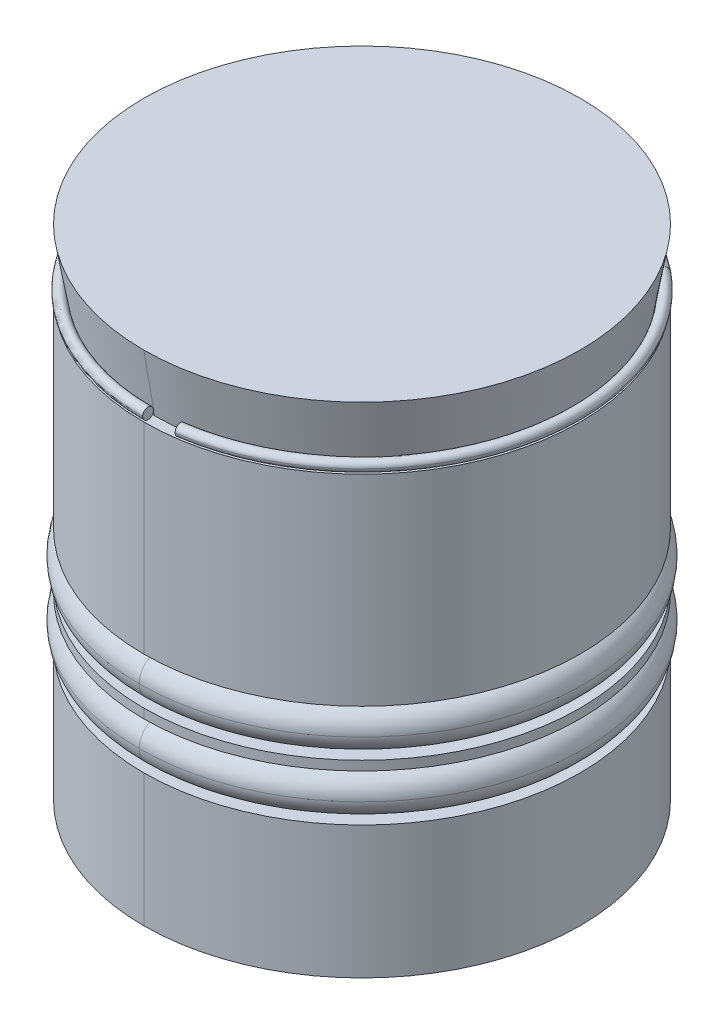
ISO-10303-21;
HEADER;
FILE_DESCRIPTION(('STEP AP214'),'2;1');
FILE_NAME('part.step','',(''),(''),'','','');
FILE_SCHEMA(('AUTOMOTIVE_DESIGN { 1 0 10303 214 1 1 1 1 }'));
ENDSEC;
DATA;
#1=APPLICATION_CONTEXT('core data for automotive mechanical design processes');
#2=APPLICATION_PROTOCOL_DEFINITION('international standard','automotive_design',2000,#1);
#3=PRODUCT_CONTEXT('',#1,'mechanical');
#4=PRODUCT('Part','Part','',(#3));
#5=PRODUCT_RELATED_PRODUCT_CATEGORY('part','',(#4));
#6=PRODUCT_DEFINITION_FORMATION('','',#4);
#7=PRODUCT_DEFINITION_CONTEXT('part definition',#1,'design');
#8=PRODUCT_DEFINITION('design','',#6,#7);
#9=PRODUCT_DEFINITION_SHAPE('','',#8);
#10=(LENGTH_UNIT() NAMED_UNIT(*) SI_UNIT(.MILLI.,.METRE.));
#11=(NAMED_UNIT(*) PLANE_ANGLE_UNIT() SI_UNIT($,.RADIAN.));
#12=(NAMED_UNIT(*) SI_UNIT($,.STERADIAN.) SOLID_ANGLE_UNIT());
#13=UNCERTAINTY_MEASURE_WITH_UNIT(LENGTH_MEASURE(1.E-05),#10,'distance_accuracy_value','');
#14=(GEOMETRIC_REPRESENTATION_CONTEXT(3) GLOBAL_UNCERTAINTY_ASSIGNED_CONTEXT((#13)) GLOBAL_UNIT_ASSIGNED_CONTEXT((#10,
#11,#12)) REPRESENTATION_CONTEXT('',''));
#15=CARTESIAN_POINT('',(0.,0.,0.));
#16=DIRECTION('',(0.,0.,1.));
#17=DIRECTION('',(1.,0.,0.));
#18=AXIS2_PLACEMENT_3D('',#15,#16,#17);
#19=CARTESIAN_POINT('',(0.,6.8,0.));
#20=DIRECTION('',(0.,1.,0.));
#21=DIRECTION('',(0.,0.,1.));
#22=AXIS2_PLACEMENT_3D('',#19,#20,#21);
#23=TOROIDAL_SURFACE('',#22,6.5,0.65);
#24=CARTESIAN_POINT('',(0.,6.8,0.));
#25=DIRECTION('',(0.,1.,0.));
#26=DIRECTION('',(0.,0.,1.));
#27=AXIS2_PLACEMENT_3D('',#24,#25,#26);
#28=CIRCLE('',#27,7.15);
#29=CARTESIAN_POINT('',(0.,6.8,-7.15));
#30=VERTEX_POINT('',#29);
#31=CARTESIAN_POINT('',(0.,6.8,7.15));
#32=VERTEX_POINT('',#31);
#33=EDGE_CURVE('P0_E57',#30,#32,#28,.T.);
#34=ORIENTED_EDGE('',*,*,#33,.F.);
#35=CARTESIAN_POINT('',(0.,6.8,-6.5));
#36=DIRECTION('',(1.,0.,0.));
#37=DIRECTION('',(0.,0.,-1.));
#38=AXIS2_PLACEMENT_3D('',#35,#36,#37);
#39=CIRCLE('',#38,0.65);
#40=CARTESIAN_POINT('',(0.,6.8,-5.85));
#41=VERTEX_POINT('',#40);
#42=EDGE_CURVE('P0_E11',#41,#30,#39,.T.);
#43=ORIENTED_EDGE('',*,*,#42,.F.);
#44=CARTESIAN_POINT('',(0.,6.8,0.));
#45=DIRECTION('',(0.,1.,0.));
#46=DIRECTION('',(0.,0.,1.));
#47=AXIS2_PLACEMENT_3D('',#44,#45,#46);
#48=CIRCLE('',#47,5.85);
#49=CARTESIAN_POINT('',(0.,6.8,5.85));
#50=VERTEX_POINT('',#49);
#51=EDGE_CURVE('P0_E54',#41,#50,#48,.T.);
#52=ORIENTED_EDGE('',*,*,#51,.T.);
#53=CARTESIAN_POINT('',(0.,6.8,6.5));
#54=DIRECTION('',(-1.,0.,0.));
#55=DIRECTION('',(0.,0.,1.));
#56=AXIS2_PLACEMENT_3D('',#53,#54,#55);
#57=CIRCLE('',#56,0.65);
#58=EDGE_CURVE('P0_E27',#50,#32,#57,.T.);
#59=ORIENTED_EDGE('',*,*,#58,.T.);
#60=EDGE_LOOP('',(#34,#43,#52,#59));
#61=FACE_BOUND('',#60,.T.);
#62=ADVANCED_FACE('P0_F16',(#61),#23,.T.);
#63=CARTESIAN_POINT('',(0.,6.8,0.));
#64=DIRECTION('',(0.,1.,0.));
#65=DIRECTION('',(0.,0.,1.));
#66=AXIS2_PLACEMENT_3D('',#63,#64,#65);
#67=TOROIDAL_SURFACE('',#66,6.5,0.65);
#68=CARTESIAN_POINT('',(0.,6.8,0.));
#69=DIRECTION('',(0.,1.,0.));
#70=DIRECTION('',(0.,0.,1.));
#71=AXIS2_PLACEMENT_3D('',#68,#69,#70);
#72=CIRCLE('',#71,7.15);
#73=EDGE_CURVE('P0_E65',#32,#30,#72,.T.);
#74=ORIENTED_EDGE('',*,*,#73,.F.);
#75=ORIENTED_EDGE('',*,*,#58,.F.);
#76=CARTESIAN_POINT('',(0.,6.8,0.));
#77=DIRECTION('',(0.,1.,0.));
#78=DIRECTION('',(0.,0.,1.));
#79=AXIS2_PLACEMENT_3D('',#76,#77,#78);
#80=CIRCLE('',#79,5.85);
#81=EDGE_CURVE('P0_E20',#50,#41,#80,.T.);
#82=ORIENTED_EDGE('',*,*,#81,.T.);
#83=ORIENTED_EDGE('',*,*,#42,.T.);
#84=EDGE_LOOP('',(#74,#75,#82,#83));
#85=FACE_BOUND('',#84,.T.);
#86=ADVANCED_FACE('P0_F60',(#85),#67,.T.);
#87=CARTESIAN_POINT('',(0.,6.8,0.));
#88=DIRECTION('',(0.,1.,0.));
#89=DIRECTION('',(0.,0.,1.));
#90=AXIS2_PLACEMENT_3D('',#87,#88,#89);
#91=TOROIDAL_SURFACE('',#90,6.5,0.65);
#92=CARTESIAN_POINT('',(0.,6.8,6.5));
#93=DIRECTION('',(-1.,0.,0.));
#94=DIRECTION('',(0.,0.,1.));
#95=AXIS2_PLACEMENT_3D('',#92,#93,#94);
#96=CIRCLE('',#95,0.65);
#97=EDGE_CURVE('P0_E69',#32,#50,#96,.T.);
#98=ORIENTED_EDGE('',*,*,#97,.F.);
#99=ORIENTED_EDGE('',*,*,#73,.T.);
#100=CARTESIAN_POINT('',(0.,6.8,-6.5));
#101=DIRECTION('',(1.,0.,0.));
#102=DIRECTION('',(0.,0.,-1.));
#103=AXIS2_PLACEMENT_3D('',#100,#101,#102);
#104=CIRCLE('',#103,0.65);
#105=EDGE_CURVE('P0_E68',#30,#41,#104,.T.);
#106=ORIENTED_EDGE('',*,*,#105,.T.);
#107=ORIENTED_EDGE('',*,*,#81,.F.);
#108=EDGE_LOOP('',(#98,#99,#106,#107));
#109=FACE_BOUND('',#108,.T.);
#110=ADVANCED_FACE('P0_F18',(#109),#91,.T.);
#111=CARTESIAN_POINT('',(0.,6.8,0.));
#112=DIRECTION('',(0.,1.,0.));
#113=DIRECTION('',(0.,0.,1.));
#114=AXIS2_PLACEMENT_3D('',#111,#112,#113);
#115=TOROIDAL_SURFACE('',#114,6.5,0.65);
#116=ORIENTED_EDGE('',*,*,#105,.F.);
#117=ORIENTED_EDGE('',*,*,#33,.T.);
#118=ORIENTED_EDGE('',*,*,#97,.T.);
#119=ORIENTED_EDGE('',*,*,#51,.F.);
#120=EDGE_LOOP('',(#116,#117,#118,#119));
#121=FACE_BOUND('',#120,.T.);
#122=ADVANCED_FACE('P0_F67',(#121),#115,.T.);
#123=CLOSED_SHELL('',(#62,#86,#110,#122));
#124=MANIFOLD_SOLID_BREP('P0_B1',#123);
#125=CARTESIAN_POINT('',(0.,5.,0.));
#126=DIRECTION('',(0.,1.,0.));
#127=DIRECTION('',(0.,0.,1.));
#128=AXIS2_PLACEMENT_3D('',#125,#126,#127);
#129=TOROIDAL_SURFACE('',#128,6.5,0.65);
#130=CARTESIAN_POINT('',(0.,5.,0.));
#131=DIRECTION('',(0.,1.,0.));
#132=DIRECTION('',(0.,0.,1.));
#133=AXIS2_PLACEMENT_3D('',#130,#131,#132);
#134=CIRCLE('',#133,7.15);
#135=CARTESIAN_POINT('',(0.,5.,-7.15));
#136=VERTEX_POINT('',#135);
#137=CARTESIAN_POINT('',(0.,5.,7.15));
#138=VERTEX_POINT('',#137);
#139=EDGE_CURVE('P1_E71',#136,#138,#134,.T.);
#140=ORIENTED_EDGE('',*,*,#139,.F.);
#141=CARTESIAN_POINT('',(0.,5.,-6.5));
#142=DIRECTION('',(1.,0.,0.));
#143=DIRECTION('',(0.,0.,-1.));
#144=AXIS2_PLACEMENT_3D('',#141,#142,#143);
#145=CIRCLE('',#144,0.65);
#146=CARTESIAN_POINT('',(0.,5.,-5.85));
#147=VERTEX_POINT('',#146);
#148=EDGE_CURVE('P1_E11',#147,#136,#145,.T.);
#149=ORIENTED_EDGE('',*,*,#148,.F.);
#150=CARTESIAN_POINT('',(0.,5.,0.));
#151=DIRECTION('',(0.,1.,0.));
#152=DIRECTION('',(0.,0.,1.));
#153=AXIS2_PLACEMENT_3D('',#150,#151,#152);
#154=CIRCLE('',#153,5.85);
#155=CARTESIAN_POINT('',(0.,5.,5.85));
#156=VERTEX_POINT('',#155);
#157=EDGE_CURVE('P1_E69',#147,#156,#154,.T.);
#158=ORIENTED_EDGE('',*,*,#157,.T.);
#159=CARTESIAN_POINT('',(0.,5.,6.5));
#160=DIRECTION('',(-1.,0.,0.));
#161=DIRECTION('',(0.,0.,1.));
#162=AXIS2_PLACEMENT_3D('',#159,#160,#161);
#163=CIRCLE('',#162,0.65);
#164=EDGE_CURVE('P1_E20',#156,#138,#163,.T.);
#165=ORIENTED_EDGE('',*,*,#164,.T.);
#166=EDGE_LOOP('',(#140,#149,#158,#165));
#167=FACE_BOUND('',#166,.T.);
#168=ADVANCED_FACE('P1_F16',(#167),#129,.T.);
#169=CARTESIAN_POINT('',(0.,5.,0.));
#170=DIRECTION('',(0.,1.,0.));
#171=DIRECTION('',(0.,0.,1.));
#172=AXIS2_PLACEMENT_3D('',#169,#170,#171);
#173=TOROIDAL_SURFACE('',#172,6.5,0.65);
#174=CARTESIAN_POINT('',(0.,5.,0.));
#175=DIRECTION('',(0.,1.,0.));
#176=DIRECTION('',(0.,0.,1.));
#177=AXIS2_PLACEMENT_3D('',#174,#175,#176);
#178=CIRCLE('',#177,7.15);
#179=EDGE_CURVE('P1_E56',#138,#136,#178,.T.);
#180=ORIENTED_EDGE('',*,*,#179,.F.);
#181=ORIENTED_EDGE('',*,*,#164,.F.);
#182=CARTESIAN_POINT('',(0.,5.,0.));
#183=DIRECTION('',(0.,1.,0.));
#184=DIRECTION('',(0.,0.,1.));
#185=AXIS2_PLACEMENT_3D('',#182,#183,#184);
#186=CIRCLE('',#185,5.85);
#187=EDGE_CURVE('P1_E58',#156,#147,#186,.T.);
#188=ORIENTED_EDGE('',*,*,#187,.T.);
#189=ORIENTED_EDGE('',*,*,#148,.T.);
#190=EDGE_LOOP('',(#180,#181,#188,#189));
#191=FACE_BOUND('',#190,.T.);
#192=ADVANCED_FACE('P1_F18',(#191),#173,.T.);
#193=CARTESIAN_POINT('',(0.,5.,0.));
#194=DIRECTION('',(0.,1.,0.));
#195=DIRECTION('',(0.,0.,1.));
#196=AXIS2_PLACEMENT_3D('',#193,#194,#195);
#197=TOROIDAL_SURFACE('',#196,6.5,0.65);
#198=CARTESIAN_POINT('',(0.,5.,6.5));
#199=DIRECTION('',(-1.,0.,0.));
#200=DIRECTION('',(0.,0.,1.));
#201=AXIS2_PLACEMENT_3D('',#198,#199,#200);
#202=CIRCLE('',#201,0.65);
#203=EDGE_CURVE('P1_E66',#138,#156,#202,.T.);
#204=ORIENTED_EDGE('',*,*,#203,.F.);
#205=ORIENTED_EDGE('',*,*,#179,.T.);
#206=CARTESIAN_POINT('',(0.,5.,-6.5));
#207=DIRECTION('',(1.,0.,0.));
#208=DIRECTION('',(0.,0.,-1.));
#209=AXIS2_PLACEMENT_3D('',#206,#207,#208);
#210=CIRCLE('',#209,0.65);
#211=EDGE_CURVE('P1_E64',#136,#147,#210,.T.);
#212=ORIENTED_EDGE('',*,*,#211,.T.);
#213=ORIENTED_EDGE('',*,*,#187,.F.);
#214=EDGE_LOOP('',(#204,#205,#212,#213));
#215=FACE_BOUND('',#214,.T.);
#216=ADVANCED_FACE('P1_F62',(#215),#197,.T.);
#217=CARTESIAN_POINT('',(0.,5.,0.));
#218=DIRECTION('',(0.,1.,0.));
#219=DIRECTION('',(0.,0.,1.));
#220=AXIS2_PLACEMENT_3D('',#217,#218,#219);
#221=TOROIDAL_SURFACE('',#220,6.5,0.65);
#222=ORIENTED_EDGE('',*,*,#211,.F.);
#223=ORIENTED_EDGE('',*,*,#139,.T.);
#224=ORIENTED_EDGE('',*,*,#203,.T.);
#225=ORIENTED_EDGE('',*,*,#157,.F.);
#226=EDGE_LOOP('',(#222,#223,#224,#225));
#227=FACE_BOUND('',#226,.T.);
#228=ADVANCED_FACE('P1_F74',(#227),#221,.T.);
#229=CLOSED_SHELL('',(#168,#192,#216,#228));
#230=MANIFOLD_SOLID_BREP('P1_B1',#229);
#231=CARTESIAN_POINT('',(0.,16.,0.));
#232=DIRECTION('',(0.,-1.,0.));
#233=DIRECTION('',(0.,0.,-1.));
#234=AXIS2_PLACEMENT_3D('',#231,#232,#233);
#235=PLANE('',#234);
#236=CARTESIAN_POINT('',(0.,16.,0.));
#237=DIRECTION('',(0.,1.,0.));
#238=DIRECTION('',(0.,0.,1.));
#239=AXIS2_PLACEMENT_3D('',#236,#237,#238);
#240=CIRCLE('',#239,7.);
#241=CARTESIAN_POINT('',(0.,16.,7.));
#242=VERTEX_POINT('',#241);
#243=CARTESIAN_POINT('',(0.,16.,-7.));
#244=VERTEX_POINT('',#243);
#245=EDGE_CURVE('P2_E204',#242,#244,#240,.T.);
#246=ORIENTED_EDGE('',*,*,#245,.T.);
#247=CARTESIAN_POINT('',(0.,16.,0.));
#248=DIRECTION('',(0.,1.,0.));
#249=DIRECTION('',(0.,0.,1.));
#250=AXIS2_PLACEMENT_3D('',#247,#248,#249);
#251=CIRCLE('',#250,7.);
#252=EDGE_CURVE('P2_E11',#244,#242,#251,.T.);
#253=ORIENTED_EDGE('',*,*,#252,.T.);
#254=EDGE_LOOP('',(#246,#253));
#255=FACE_BOUND('',#254,.T.);
#256=ADVANCED_FACE('P2_F16',(#255),#235,.F.);
#257=CARTESIAN_POINT('',(0.,14.,0.));
#258=DIRECTION('',(0.,1.,0.));
#259=DIRECTION('',(0.,0.,1.));
#260=AXIS2_PLACEMENT_3D('',#257,#258,#259);
#261=CONICAL_SURFACE('',#260,6.65371595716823,0.171442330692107);
#262=DIRECTION('',(0.,0.985339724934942,-0.17060371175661));
#263=VECTOR('',#262,1.);
#264=CARTESIAN_POINT('',(0.,14.,-6.65371595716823));
#265=LINE('',#264,#263);
#266=CARTESIAN_POINT('',(0.,14.,-6.65371595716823));
#267=VERTEX_POINT('',#266);
#268=EDGE_CURVE('P2_E217',#267,#244,#265,.T.);
#269=ORIENTED_EDGE('',*,*,#268,.F.);
#270=CARTESIAN_POINT('',(0.,14.,0.));
#271=DIRECTION('',(0.,1.,0.));
#272=DIRECTION('',(0.,0.,1.));
#273=AXIS2_PLACEMENT_3D('',#270,#271,#272);
#274=CIRCLE('',#273,6.65371595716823);
#275=CARTESIAN_POINT('',(0.,14.,6.65371595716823));
#276=VERTEX_POINT('',#275);
#277=EDGE_CURVE('P2_E27',#267,#276,#274,.T.);
#278=ORIENTED_EDGE('',*,*,#277,.T.);
#279=DIRECTION('',(0.,0.985339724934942,0.17060371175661));
#280=VECTOR('',#279,1.);
#281=CARTESIAN_POINT('',(0.,14.,6.65371595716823));
#282=LINE('',#281,#280);
#283=EDGE_CURVE('P2_E197',#276,#242,#282,.T.);
#284=ORIENTED_EDGE('',*,*,#283,.T.);
#285=ORIENTED_EDGE('',*,*,#252,.F.);
#286=EDGE_LOOP('',(#269,#278,#284,#285));
#287=FACE_BOUND('',#286,.T.);
#288=ADVANCED_FACE('P2_F400',(#287),#261,.T.);
#289=CARTESIAN_POINT('',(0.,14.,-7.));
#290=DIRECTION('',(0.,-1.,0.));
#291=DIRECTION('',(0.,0.,-1.));
#292=AXIS2_PLACEMENT_3D('',#289,#290,#291);
#293=PLANE('',#292);
#294=CARTESIAN_POINT('',(0.,14.,0.));
#295=DIRECTION('',(0.,1.,0.));
#296=DIRECTION('',(0.,0.,1.));
#297=AXIS2_PLACEMENT_3D('',#294,#295,#296);
#298=CIRCLE('',#297,6.65371595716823);
#299=EDGE_CURVE('P2_E221',#276,#267,#298,.T.);
#300=ORIENTED_EDGE('',*,*,#299,.F.);
#301=ORIENTED_EDGE('',*,*,#277,.F.);
#302=EDGE_LOOP('',(#300,#301));
#303=FACE_BOUND('',#302,.T.);
#304=CARTESIAN_POINT('',(0.,14.,0.));
#305=DIRECTION('',(0.,1.,0.));
#306=DIRECTION('',(0.,0.,1.));
#307=AXIS2_PLACEMENT_3D('',#304,#305,#306);
#308=CIRCLE('',#307,7.);
#309=CARTESIAN_POINT('',(0.,14.,7.));
#310=VERTEX_POINT('',#309);
#311=CARTESIAN_POINT('',(0.,14.,-7.));
#312=VERTEX_POINT('',#311);
#313=EDGE_CURVE('P2_E192',#310,#312,#308,.T.);
#314=ORIENTED_EDGE('',*,*,#313,.T.);
#315=CARTESIAN_POINT('',(0.,14.,0.));
#316=DIRECTION('',(0.,1.,0.));
#317=DIRECTION('',(0.,0.,1.));
#318=AXIS2_PLACEMENT_3D('',#315,#316,#317);
#319=CIRCLE('',#318,7.);
#320=EDGE_CURVE('P2_E140',#312,#310,#319,.T.);
#321=ORIENTED_EDGE('',*,*,#320,.T.);
#322=EDGE_LOOP('',(#314,#321));
#323=FACE_BOUND('',#322,.T.);
#324=ADVANCED_FACE('P2_F406',(#303,#323),#293,.F.);
#325=CARTESIAN_POINT('',(0.,16.,0.));
#326=DIRECTION('',(0.,1.,0.));
#327=DIRECTION('',(0.,0.,1.));
#328=AXIS2_PLACEMENT_3D('',#325,#326,#327);
#329=CYLINDRICAL_SURFACE('',#328,7.);
#330=DIRECTION('',(0.,1.,0.));
#331=VECTOR('',#330,1.);
#332=CARTESIAN_POINT('',(0.,16.,-7.));
#333=LINE('',#332,#331);
#334=CARTESIAN_POINT('',(0.,7.55,-7.));
#335=VERTEX_POINT('',#334);
#336=EDGE_CURVE('P2_E187',#335,#312,#333,.T.);
#337=ORIENTED_EDGE('',*,*,#336,.F.);
#338=CARTESIAN_POINT('',(0.,7.55,0.));
#339=DIRECTION('',(0.,1.,0.));
#340=DIRECTION('',(0.,0.,1.));
#341=AXIS2_PLACEMENT_3D('',#338,#339,#340);
#342=CIRCLE('',#341,7.);
#343=CARTESIAN_POINT('',(0.,7.55,7.));
#344=VERTEX_POINT('',#343);
#345=EDGE_CURVE('P2_E20',#335,#344,#342,.T.);
#346=ORIENTED_EDGE('',*,*,#345,.T.);
#347=DIRECTION('',(0.,1.,0.));
#348=VECTOR('',#347,1.);
#349=CARTESIAN_POINT('',(0.,16.,7.));
#350=LINE('',#349,#348);
#351=EDGE_CURVE('P2_E195',#344,#310,#350,.T.);
#352=ORIENTED_EDGE('',*,*,#351,.T.);
#353=ORIENTED_EDGE('',*,*,#320,.F.);
#354=EDGE_LOOP('',(#337,#346,#352,#353));
#355=FACE_BOUND('',#354,.T.);
#356=ADVANCED_FACE('P2_F188',(#355),#329,.T.);
#357=CARTESIAN_POINT('',(0.,7.55,-6.5));
#358=DIRECTION('',(0.,1.,0.));
#359=DIRECTION('',(0.,0.,-1.));
#360=AXIS2_PLACEMENT_3D('',#357,#358,#359);
#361=PLANE('',#360);
#362=CARTESIAN_POINT('',(0.,7.55,0.));
#363=DIRECTION('',(0.,1.,0.));
#364=DIRECTION('',(0.,0.,1.));
#365=AXIS2_PLACEMENT_3D('',#362,#363,#364);
#366=CIRCLE('',#365,6.5);
#367=CARTESIAN_POINT('',(0.,7.55,6.5));
#368=VERTEX_POINT('',#367);
#369=CARTESIAN_POINT('',(0.,7.55,-6.5));
#370=VERTEX_POINT('',#369);
#371=EDGE_CURVE('P2_E215',#368,#370,#366,.T.);
#372=ORIENTED_EDGE('',*,*,#371,.T.);
#373=CARTESIAN_POINT('',(0.,7.55,0.));
#374=DIRECTION('',(0.,1.,0.));
#375=DIRECTION('',(0.,0.,1.));
#376=AXIS2_PLACEMENT_3D('',#373,#374,#375);
#377=CIRCLE('',#376,6.5);
#378=EDGE_CURVE('P2_E77',#370,#368,#377,.T.);
#379=ORIENTED_EDGE('',*,*,#378,.T.);
#380=EDGE_LOOP('',(#372,#379));
#381=FACE_BOUND('',#380,.T.);
#382=CARTESIAN_POINT('',(0.,7.55,0.));
#383=DIRECTION('',(0.,1.,0.));
#384=DIRECTION('',(0.,0.,1.));
#385=AXIS2_PLACEMENT_3D('',#382,#383,#384);
#386=CIRCLE('',#385,7.);
#387=EDGE_CURVE('P2_E182',#344,#335,#386,.T.);
#388=ORIENTED_EDGE('',*,*,#387,.F.);
#389=ORIENTED_EDGE('',*,*,#345,.F.);
#390=EDGE_LOOP('',(#388,#389));
#391=FACE_BOUND('',#390,.T.);
#392=ADVANCED_FACE('P2_F180',(#381,#391),#361,.F.);
#393=CARTESIAN_POINT('',(0.,6.8,0.));
#394=DIRECTION('',(0.,1.,0.));
#395=DIRECTION('',(0.,0.,1.));
#396=AXIS2_PLACEMENT_3D('',#393,#394,#395);
#397=TOROIDAL_SURFACE('',#396,6.5,0.75);
#398=CARTESIAN_POINT('',(0.,6.8,0.));
#399=DIRECTION('',(0.,1.,0.));
#400=DIRECTION('',(0.,0.,1.));
#401=AXIS2_PLACEMENT_3D('',#398,#399,#400);
#402=CIRCLE('',#401,5.75);
#403=CARTESIAN_POINT('',(0.,6.8,5.75));
#404=VERTEX_POINT('',#403);
#405=CARTESIAN_POINT('',(0.,6.8,-5.75));
#406=VERTEX_POINT('',#405);
#407=EDGE_CURVE('P2_E216',#404,#406,#402,.T.);
#408=ORIENTED_EDGE('',*,*,#407,.F.);
#409=CARTESIAN_POINT('',(0.,6.8,6.5));
#410=DIRECTION('',(-1.,0.,0.));
#411=DIRECTION('',(0.,0.,1.));
#412=AXIS2_PLACEMENT_3D('',#409,#410,#411);
#413=CIRCLE('',#412,0.75);
#414=CARTESIAN_POINT('',(0.,6.05,6.5));
#415=VERTEX_POINT('',#414);
#416=EDGE_CURVE('P2_E94',#404,#415,#413,.T.);
#417=ORIENTED_EDGE('',*,*,#416,.T.);
#418=CARTESIAN_POINT('',(0.,6.05,0.));
#419=DIRECTION('',(0.,1.,0.));
#420=DIRECTION('',(0.,0.,1.));
#421=AXIS2_PLACEMENT_3D('',#418,#419,#420);
#422=CIRCLE('',#421,6.5);
#423=CARTESIAN_POINT('',(0.,6.05,-6.5));
#424=VERTEX_POINT('',#423);
#425=EDGE_CURVE('P2_E127',#415,#424,#422,.T.);
#426=ORIENTED_EDGE('',*,*,#425,.T.);
#427=CARTESIAN_POINT('',(0.,6.8,-6.5));
#428=DIRECTION('',(1.,0.,0.));
#429=DIRECTION('',(0.,0.,-1.));
#430=AXIS2_PLACEMENT_3D('',#427,#428,#429);
#431=CIRCLE('',#430,0.75);
#432=EDGE_CURVE('P2_E231',#406,#424,#431,.T.);
#433=ORIENTED_EDGE('',*,*,#432,.F.);
#434=EDGE_LOOP('',(#408,#417,#426,#433));
#435=FACE_BOUND('',#434,.T.);
#436=ADVANCED_FACE('P2_F348',(#435),#397,.F.);
#437=CARTESIAN_POINT('',(0.,6.05,-6.5));
#438=DIRECTION('',(0.,-1.,0.));
#439=DIRECTION('',(0.,0.,-1.));
#440=AXIS2_PLACEMENT_3D('',#437,#438,#439);
#441=PLANE('',#440);
#442=ORIENTED_EDGE('',*,*,#425,.F.);
#443=CARTESIAN_POINT('',(0.,6.05,0.));
#444=DIRECTION('',(0.,1.,0.));
#445=DIRECTION('',(0.,0.,1.));
#446=AXIS2_PLACEMENT_3D('',#443,#444,#445);
#447=CIRCLE('',#446,6.5);
#448=EDGE_CURVE('P2_E235',#424,#415,#447,.T.);
#449=ORIENTED_EDGE('',*,*,#448,.F.);
#450=EDGE_LOOP('',(#442,#449));
#451=FACE_BOUND('',#450,.T.);
#452=CARTESIAN_POINT('',(0.,6.05,0.));
#453=DIRECTION('',(0.,1.,0.));
#454=DIRECTION('',(0.,0.,1.));
#455=AXIS2_PLACEMENT_3D('',#452,#453,#454);
#456=CIRCLE('',#455,7.);
#457=CARTESIAN_POINT('',(0.,6.05,7.));
#458=VERTEX_POINT('',#457);
#459=CARTESIAN_POINT('',(0.,6.05,-7.));
#460=VERTEX_POINT('',#459);
#461=EDGE_CURVE('P2_E251',#458,#460,#456,.T.);
#462=ORIENTED_EDGE('',*,*,#461,.T.);
#463=CARTESIAN_POINT('',(0.,6.05,0.));
#464=DIRECTION('',(0.,1.,0.));
#465=DIRECTION('',(0.,0.,1.));
#466=AXIS2_PLACEMENT_3D('',#463,#464,#465);
#467=CIRCLE('',#466,7.);
#468=EDGE_CURVE('P2_E240',#460,#458,#467,.T.);
#469=ORIENTED_EDGE('',*,*,#468,.T.);
#470=EDGE_LOOP('',(#462,#469));
#471=FACE_BOUND('',#470,.T.);
#472=ADVANCED_FACE('P2_F351',(#451,#471),#441,.F.);
#473=CARTESIAN_POINT('',(0.,16.,0.));
#474=DIRECTION('',(0.,1.,0.));
#475=DIRECTION('',(0.,0.,1.));
#476=AXIS2_PLACEMENT_3D('',#473,#474,#475);
#477=CYLINDRICAL_SURFACE('',#476,7.);
#478=DIRECTION('',(0.,1.,0.));
#479=VECTOR('',#478,1.);
#480=CARTESIAN_POINT('',(0.,16.,-7.));
#481=LINE('',#480,#479);
#482=CARTESIAN_POINT('',(0.,5.75,-7.));
#483=VERTEX_POINT('',#482);
#484=EDGE_CURVE('P2_E256',#483,#460,#481,.T.);
#485=ORIENTED_EDGE('',*,*,#484,.F.);
#486=CARTESIAN_POINT('',(0.,5.75,0.));
#487=DIRECTION('',(0.,1.,0.));
#488=DIRECTION('',(0.,0.,1.));
#489=AXIS2_PLACEMENT_3D('',#486,#487,#488);
#490=CIRCLE('',#489,7.);
#491=CARTESIAN_POINT('',(0.,5.75,7.));
#492=VERTEX_POINT('',#491);
#493=EDGE_CURVE('P2_E239',#483,#492,#490,.T.);
#494=ORIENTED_EDGE('',*,*,#493,.T.);
#495=DIRECTION('',(0.,1.,0.));
#496=VECTOR('',#495,1.);
#497=CARTESIAN_POINT('',(0.,16.,7.));
#498=LINE('',#497,#496);
#499=EDGE_CURVE('P2_E255',#492,#458,#498,.T.);
#500=ORIENTED_EDGE('',*,*,#499,.T.);
#501=ORIENTED_EDGE('',*,*,#468,.F.);
#502=EDGE_LOOP('',(#485,#494,#500,#501));
#503=FACE_BOUND('',#502,.T.);
#504=ADVANCED_FACE('P2_F354',(#503),#477,.T.);
#505=CARTESIAN_POINT('',(0.,5.75,-6.5));
#506=DIRECTION('',(0.,1.,0.));
#507=DIRECTION('',(0.,0.,-1.));
#508=AXIS2_PLACEMENT_3D('',#505,#506,#507);
#509=PLANE('',#508);
#510=CARTESIAN_POINT('',(0.,5.75,0.));
#511=DIRECTION('',(0.,1.,0.));
#512=DIRECTION('',(0.,0.,1.));
#513=AXIS2_PLACEMENT_3D('',#510,#511,#512);
#514=CIRCLE('',#513,6.5);
#515=CARTESIAN_POINT('',(0.,5.75,6.5));
#516=VERTEX_POINT('',#515);
#517=CARTESIAN_POINT('',(0.,5.75,-6.5));
#518=VERTEX_POINT('',#517);
#519=EDGE_CURVE('P2_E314',#516,#518,#514,.T.);
#520=ORIENTED_EDGE('',*,*,#519,.T.);
#521=CARTESIAN_POINT('',(0.,5.75,0.));
#522=DIRECTION('',(0.,1.,0.));
#523=DIRECTION('',(0.,0.,1.));
#524=AXIS2_PLACEMENT_3D('',#521,#522,#523);
#525=CIRCLE('',#524,6.5);
#526=EDGE_CURVE('P2_E59',#518,#516,#525,.T.);
#527=ORIENTED_EDGE('',*,*,#526,.T.);
#528=EDGE_LOOP('',(#520,#527));
#529=FACE_BOUND('',#528,.T.);
#530=CARTESIAN_POINT('',(0.,5.75,0.));
#531=DIRECTION('',(0.,1.,0.));
#532=DIRECTION('',(0.,0.,1.));
#533=AXIS2_PLACEMENT_3D('',#530,#531,#532);
#534=CIRCLE('',#533,7.);
#535=EDGE_CURVE('P2_E303',#492,#483,#534,.T.);
#536=ORIENTED_EDGE('',*,*,#535,.F.);
#537=ORIENTED_EDGE('',*,*,#493,.F.);
#538=EDGE_LOOP('',(#536,#537));
#539=FACE_BOUND('',#538,.T.);
#540=ADVANCED_FACE('P2_F412',(#529,#539),#509,.F.);
#541=CARTESIAN_POINT('',(0.,5.,0.));
#542=DIRECTION('',(0.,1.,0.));
#543=DIRECTION('',(0.,0.,1.));
#544=AXIS2_PLACEMENT_3D('',#541,#542,#543);
#545=TOROIDAL_SURFACE('',#544,6.5,0.75);
#546=CARTESIAN_POINT('',(0.,5.,0.));
#547=DIRECTION('',(0.,1.,0.));
#548=DIRECTION('',(0.,0.,1.));
#549=AXIS2_PLACEMENT_3D('',#546,#547,#548);
#550=CIRCLE('',#549,5.75);
#551=CARTESIAN_POINT('',(0.,5.,5.75));
#552=VERTEX_POINT('',#551);
#553=CARTESIAN_POINT('',(0.,5.,-5.75));
#554=VERTEX_POINT('',#553);
#555=EDGE_CURVE('P2_E294',#552,#554,#550,.T.);
#556=ORIENTED_EDGE('',*,*,#555,.F.);
#557=CARTESIAN_POINT('',(0.,5.,6.5));
#558=DIRECTION('',(-1.,0.,0.));
#559=DIRECTION('',(0.,0.,1.));
#560=AXIS2_PLACEMENT_3D('',#557,#558,#559);
#561=CIRCLE('',#560,0.75);
#562=CARTESIAN_POINT('',(0.,4.25,6.5));
#563=VERTEX_POINT('',#562);
#564=EDGE_CURVE('P2_E229',#552,#563,#561,.T.);
#565=ORIENTED_EDGE('',*,*,#564,.T.);
#566=CARTESIAN_POINT('',(0.,4.25,0.));
#567=DIRECTION('',(0.,1.,0.));
#568=DIRECTION('',(0.,0.,1.));
#569=AXIS2_PLACEMENT_3D('',#566,#567,#568);
#570=CIRCLE('',#569,6.5);
#571=CARTESIAN_POINT('',(0.,4.25,-6.5));
#572=VERTEX_POINT('',#571);
#573=EDGE_CURVE('P2_E236',#563,#572,#570,.T.);
#574=ORIENTED_EDGE('',*,*,#573,.T.);
#575=CARTESIAN_POINT('',(0.,5.,-6.5));
#576=DIRECTION('',(1.,0.,0.));
#577=DIRECTION('',(0.,0.,-1.));
#578=AXIS2_PLACEMENT_3D('',#575,#576,#577);
#579=CIRCLE('',#578,0.75);
#580=EDGE_CURVE('P2_E230',#554,#572,#579,.T.);
#581=ORIENTED_EDGE('',*,*,#580,.F.);
#582=EDGE_LOOP('',(#556,#565,#574,#581));
#583=FACE_BOUND('',#582,.T.);
#584=ADVANCED_FACE('P2_F374',(#583),#545,.F.);
#585=CARTESIAN_POINT('',(0.,4.25,-6.5));
#586=DIRECTION('',(0.,-1.,0.));
#587=DIRECTION('',(0.,0.,-1.));
#588=AXIS2_PLACEMENT_3D('',#585,#586,#587);
#589=PLANE('',#588);
#590=ORIENTED_EDGE('',*,*,#573,.F.);
#591=CARTESIAN_POINT('',(0.,4.25,0.));
#592=DIRECTION('',(0.,1.,0.));
#593=DIRECTION('',(0.,0.,1.));
#594=AXIS2_PLACEMENT_3D('',#591,#592,#593);
#595=CIRCLE('',#594,6.5);
#596=EDGE_CURVE('P2_E225',#572,#563,#595,.T.);
#597=ORIENTED_EDGE('',*,*,#596,.F.);
#598=EDGE_LOOP('',(#590,#597));
#599=FACE_BOUND('',#598,.T.);
#600=CARTESIAN_POINT('',(0.,4.25,0.));
#601=DIRECTION('',(0.,1.,0.));
#602=DIRECTION('',(0.,0.,1.));
#603=AXIS2_PLACEMENT_3D('',#600,#601,#602);
#604=CIRCLE('',#603,7.);
#605=CARTESIAN_POINT('',(0.,4.25,7.));
#606=VERTEX_POINT('',#605);
#607=CARTESIAN_POINT('',(0.,4.25,-7.));
#608=VERTEX_POINT('',#607);
#609=EDGE_CURVE('P2_E266',#606,#608,#604,.T.);
#610=ORIENTED_EDGE('',*,*,#609,.T.);
#611=CARTESIAN_POINT('',(0.,4.25,0.));
#612=DIRECTION('',(0.,1.,0.));
#613=DIRECTION('',(0.,0.,1.));
#614=AXIS2_PLACEMENT_3D('',#611,#612,#613);
#615=CIRCLE('',#614,7.);
#616=EDGE_CURVE('P2_E41',#608,#606,#615,.T.);
#617=ORIENTED_EDGE('',*,*,#616,.T.);
#618=EDGE_LOOP('',(#610,#617));
#619=FACE_BOUND('',#618,.T.);
#620=ADVANCED_FACE('P2_F377',(#599,#619),#589,.F.);
#621=CARTESIAN_POINT('',(0.,16.,0.));
#622=DIRECTION('',(0.,1.,0.));
#623=DIRECTION('',(0.,0.,1.));
#624=AXIS2_PLACEMENT_3D('',#621,#622,#623);
#625=CYLINDRICAL_SURFACE('',#624,7.);
#626=DIRECTION('',(0.,1.,0.));
#627=VECTOR('',#626,1.);
#628=CARTESIAN_POINT('',(0.,16.,-7.));
#629=LINE('',#628,#627);
#630=CARTESIAN_POINT('',(0.,0.,-7.));
#631=VERTEX_POINT('',#630);
#632=EDGE_CURVE('P2_E273',#631,#608,#629,.T.);
#633=ORIENTED_EDGE('',*,*,#632,.F.);
#634=CARTESIAN_POINT('',(0.,0.,0.));
#635=DIRECTION('',(0.,1.,0.));
#636=DIRECTION('',(0.,0.,1.));
#637=AXIS2_PLACEMENT_3D('',#634,#635,#636);
#638=CIRCLE('',#637,7.);
#639=CARTESIAN_POINT('',(0.,0.,7.));
#640=VERTEX_POINT('',#639);
#641=EDGE_CURVE('P2_E208',#631,#640,#638,.T.);
#642=ORIENTED_EDGE('',*,*,#641,.T.);
#643=DIRECTION('',(0.,1.,0.));
#644=VECTOR('',#643,1.);
#645=CARTESIAN_POINT('',(0.,16.,7.));
#646=LINE('',#645,#644);
#647=EDGE_CURVE('P2_E211',#640,#606,#646,.T.);
#648=ORIENTED_EDGE('',*,*,#647,.T.);
#649=ORIENTED_EDGE('',*,*,#616,.F.);
#650=EDGE_LOOP('',(#633,#642,#648,#649));
#651=FACE_BOUND('',#650,.T.);
#652=ADVANCED_FACE('P2_F379',(#651),#625,.T.);
#653=CARTESIAN_POINT('',(0.,0.,-7.));
#654=DIRECTION('',(0.,1.,0.));
#655=DIRECTION('',(0.,0.,-1.));
#656=AXIS2_PLACEMENT_3D('',#653,#654,#655);
#657=PLANE('',#656);
#658=CARTESIAN_POINT('',(0.,0.,0.));
#659=DIRECTION('',(0.,1.,0.));
#660=DIRECTION('',(0.,0.,1.));
#661=AXIS2_PLACEMENT_3D('',#658,#659,#660);
#662=CIRCLE('',#661,7.);
#663=EDGE_CURVE('P2_E270',#640,#631,#662,.T.);
#664=ORIENTED_EDGE('',*,*,#663,.F.);
#665=ORIENTED_EDGE('',*,*,#641,.F.);
#666=EDGE_LOOP('',(#664,#665));
#667=FACE_BOUND('',#666,.T.);
#668=ADVANCED_FACE('P2_F387',(#667),#657,.F.);
#669=CARTESIAN_POINT('',(0.,16.,0.));
#670=DIRECTION('',(0.,1.,0.));
#671=DIRECTION('',(0.,0.,1.));
#672=AXIS2_PLACEMENT_3D('',#669,#670,#671);
#673=CYLINDRICAL_SURFACE('',#672,7.);
#674=ORIENTED_EDGE('',*,*,#663,.T.);
#675=ORIENTED_EDGE('',*,*,#632,.T.);
#676=ORIENTED_EDGE('',*,*,#609,.F.);
#677=ORIENTED_EDGE('',*,*,#647,.F.);
#678=EDGE_LOOP('',(#674,#675,#676,#677));
#679=FACE_BOUND('',#678,.T.);
#680=ADVANCED_FACE('P2_F383',(#679),#673,.T.);
#681=CARTESIAN_POINT('',(0.,5.,0.));
#682=DIRECTION('',(0.,1.,0.));
#683=DIRECTION('',(0.,0.,1.));
#684=AXIS2_PLACEMENT_3D('',#681,#682,#683);
#685=TOROIDAL_SURFACE('',#684,6.5,0.75);
#686=CARTESIAN_POINT('',(0.,5.,0.));
#687=DIRECTION('',(0.,1.,0.));
#688=DIRECTION('',(0.,0.,1.));
#689=AXIS2_PLACEMENT_3D('',#686,#687,#688);
#690=CIRCLE('',#689,5.75);
#691=EDGE_CURVE('P2_E250',#554,#552,#690,.T.);
#692=ORIENTED_EDGE('',*,*,#691,.F.);
#693=ORIENTED_EDGE('',*,*,#580,.T.);
#694=ORIENTED_EDGE('',*,*,#596,.T.);
#695=ORIENTED_EDGE('',*,*,#564,.F.);
#696=EDGE_LOOP('',(#692,#693,#694,#695));
#697=FACE_BOUND('',#696,.T.);
#698=ADVANCED_FACE('P2_F372',(#697),#685,.F.);
#699=CARTESIAN_POINT('',(0.,16.,0.));
#700=DIRECTION('',(0.,1.,0.));
#701=DIRECTION('',(0.,0.,1.));
#702=AXIS2_PLACEMENT_3D('',#699,#700,#701);
#703=CYLINDRICAL_SURFACE('',#702,7.);
#704=ORIENTED_EDGE('',*,*,#535,.T.);
#705=ORIENTED_EDGE('',*,*,#484,.T.);
#706=ORIENTED_EDGE('',*,*,#461,.F.);
#707=ORIENTED_EDGE('',*,*,#499,.F.);
#708=EDGE_LOOP('',(#704,#705,#706,#707));
#709=FACE_BOUND('',#708,.T.);
#710=ADVANCED_FACE('P2_F361',(#709),#703,.T.);
#711=CARTESIAN_POINT('',(0.,6.8,0.));
#712=DIRECTION('',(0.,1.,0.));
#713=DIRECTION('',(0.,0.,1.));
#714=AXIS2_PLACEMENT_3D('',#711,#712,#713);
#715=TOROIDAL_SURFACE('',#714,6.5,0.75);
#716=CARTESIAN_POINT('',(0.,6.8,0.));
#717=DIRECTION('',(0.,1.,0.));
#718=DIRECTION('',(0.,0.,1.));
#719=AXIS2_PLACEMENT_3D('',#716,#717,#718);
#720=CIRCLE('',#719,5.75);
#721=EDGE_CURVE('P2_E249',#406,#404,#720,.T.);
#722=ORIENTED_EDGE('',*,*,#721,.F.);
#723=ORIENTED_EDGE('',*,*,#432,.T.);
#724=ORIENTED_EDGE('',*,*,#448,.T.);
#725=ORIENTED_EDGE('',*,*,#416,.F.);
#726=EDGE_LOOP('',(#722,#723,#724,#725));
#727=FACE_BOUND('',#726,.T.);
#728=ADVANCED_FACE('P2_F349',(#727),#715,.F.);
#729=CARTESIAN_POINT('',(0.,16.,0.));
#730=DIRECTION('',(0.,1.,0.));
#731=DIRECTION('',(0.,0.,1.));
#732=AXIS2_PLACEMENT_3D('',#729,#730,#731);
#733=CYLINDRICAL_SURFACE('',#732,7.);
#734=ORIENTED_EDGE('',*,*,#387,.T.);
#735=ORIENTED_EDGE('',*,*,#336,.T.);
#736=ORIENTED_EDGE('',*,*,#313,.F.);
#737=ORIENTED_EDGE('',*,*,#351,.F.);
#738=EDGE_LOOP('',(#734,#735,#736,#737));
#739=FACE_BOUND('',#738,.T.);
#740=ADVANCED_FACE('P2_F194',(#739),#733,.T.);
#741=CARTESIAN_POINT('',(0.,14.,0.));
#742=DIRECTION('',(0.,1.,0.));
#743=DIRECTION('',(0.,0.,1.));
#744=AXIS2_PLACEMENT_3D('',#741,#742,#743);
#745=CONICAL_SURFACE('',#744,6.65371595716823,0.171442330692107);
#746=ORIENTED_EDGE('',*,*,#299,.T.);
#747=ORIENTED_EDGE('',*,*,#268,.T.);
#748=ORIENTED_EDGE('',*,*,#245,.F.);
#749=ORIENTED_EDGE('',*,*,#283,.F.);
#750=EDGE_LOOP('',(#746,#747,#748,#749));
#751=FACE_BOUND('',#750,.T.);
#752=ADVANCED_FACE('P2_F18',(#751),#745,.T.);
#753=CARTESIAN_POINT('',(0.,6.8,0.));
#754=DIRECTION('',(0.,1.,0.));
#755=DIRECTION('',(0.,0.,1.));
#756=AXIS2_PLACEMENT_3D('',#753,#754,#755);
#757=TOROIDAL_SURFACE('',#756,6.5,0.75);
#758=CARTESIAN_POINT('',(0.,6.8,-6.5));
#759=DIRECTION('',(1.,0.,0.));
#760=DIRECTION('',(0.,0.,-1.));
#761=AXIS2_PLACEMENT_3D('',#758,#759,#760);
#762=CIRCLE('',#761,0.75);
#763=EDGE_CURVE('P2_E212',#370,#406,#762,.T.);
#764=ORIENTED_EDGE('',*,*,#763,.T.);
#765=ORIENTED_EDGE('',*,*,#721,.T.);
#766=CARTESIAN_POINT('',(0.,6.8,6.5));
#767=DIRECTION('',(-1.,0.,0.));
#768=DIRECTION('',(0.,0.,1.));
#769=AXIS2_PLACEMENT_3D('',#766,#767,#768);
#770=CIRCLE('',#769,0.75);
#771=EDGE_CURVE('P2_E260',#368,#404,#770,.T.);
#772=ORIENTED_EDGE('',*,*,#771,.F.);
#773=ORIENTED_EDGE('',*,*,#378,.F.);
#774=EDGE_LOOP('',(#764,#765,#772,#773));
#775=FACE_BOUND('',#774,.T.);
#776=ADVANCED_FACE('P2_F418',(#775),#757,.F.);
#777=CARTESIAN_POINT('',(0.,5.,0.));
#778=DIRECTION('',(0.,1.,0.));
#779=DIRECTION('',(0.,0.,1.));
#780=AXIS2_PLACEMENT_3D('',#777,#778,#779);
#781=TOROIDAL_SURFACE('',#780,6.5,0.75);
#782=CARTESIAN_POINT('',(0.,5.,-6.5));
#783=DIRECTION('',(1.,0.,0.));
#784=DIRECTION('',(0.,0.,-1.));
#785=AXIS2_PLACEMENT_3D('',#782,#783,#784);
#786=CIRCLE('',#785,0.75);
#787=EDGE_CURVE('P2_E297',#518,#554,#786,.T.);
#788=ORIENTED_EDGE('',*,*,#787,.T.);
#789=ORIENTED_EDGE('',*,*,#691,.T.);
#790=CARTESIAN_POINT('',(0.,5.,6.5));
#791=DIRECTION('',(-1.,0.,0.));
#792=DIRECTION('',(0.,0.,1.));
#793=AXIS2_PLACEMENT_3D('',#790,#791,#792);
#794=CIRCLE('',#793,0.75);
#795=EDGE_CURVE('P2_E298',#516,#552,#794,.T.);
#796=ORIENTED_EDGE('',*,*,#795,.F.);
#797=ORIENTED_EDGE('',*,*,#526,.F.);
#798=EDGE_LOOP('',(#788,#789,#796,#797));
#799=FACE_BOUND('',#798,.T.);
#800=ADVANCED_FACE('P2_F414',(#799),#781,.F.);
#801=CARTESIAN_POINT('',(0.,5.,0.));
#802=DIRECTION('',(0.,1.,0.));
#803=DIRECTION('',(0.,0.,1.));
#804=AXIS2_PLACEMENT_3D('',#801,#802,#803);
#805=TOROIDAL_SURFACE('',#804,6.5,0.75);
#806=ORIENTED_EDGE('',*,*,#795,.T.);
#807=ORIENTED_EDGE('',*,*,#555,.T.);
#808=ORIENTED_EDGE('',*,*,#787,.F.);
#809=ORIENTED_EDGE('',*,*,#519,.F.);
#810=EDGE_LOOP('',(#806,#807,#808,#809));
#811=FACE_BOUND('',#810,.T.);
#812=ADVANCED_FACE('P2_F417',(#811),#805,.F.);
#813=CARTESIAN_POINT('',(0.,6.8,0.));
#814=DIRECTION('',(0.,1.,0.));
#815=DIRECTION('',(0.,0.,1.));
#816=AXIS2_PLACEMENT_3D('',#813,#814,#815);
#817=TOROIDAL_SURFACE('',#816,6.5,0.75);
#818=ORIENTED_EDGE('',*,*,#771,.T.);
#819=ORIENTED_EDGE('',*,*,#407,.T.);
#820=ORIENTED_EDGE('',*,*,#763,.F.);
#821=ORIENTED_EDGE('',*,*,#371,.F.);
#822=EDGE_LOOP('',(#818,#819,#820,#821));
#823=FACE_BOUND('',#822,.T.);
#824=ADVANCED_FACE('P2_F430',(#823),#817,.F.);
#825=CLOSED_SHELL('',(#256,#288,#324,#356,#392,#436,#472,#504,#540,#584,#620,#652,#668,#680,
#698,#710,#728,#740,#752,#776,#800,#812,#824));
#826=MANIFOLD_SOLID_BREP('P2_B1',#825);
#827=CARTESIAN_POINT('',(0.951107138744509,14.175,6.79796970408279));
#828=DIRECTION('',(0.990353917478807,0.,-0.138560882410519));
#829=DIRECTION('',(0.,-1.,0.));
#830=AXIS2_PLACEMENT_3D('',#827,#828,#829);
#831=PLANE('',#830);
#832=CARTESIAN_POINT('',(0.951107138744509,14.175,6.79796970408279));
#833=DIRECTION('',(0.990353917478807,0.,-0.138560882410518));
#834=DIRECTION('',(-0.138560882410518,0.,-0.990353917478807));
#835=AXIS2_PLACEMENT_3D('',#832,#833,#834);
#836=CIRCLE('',#835,0.175);
#837=CARTESIAN_POINT('',(0.926858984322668,14.175,6.624657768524));
#838=VERTEX_POINT('',#837);
#839=CARTESIAN_POINT('',(0.97535529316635,14.175,6.97128163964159));
#840=VERTEX_POINT('',#839);
#841=EDGE_CURVE('P3_E62',#838,#840,#836,.T.);
#842=ORIENTED_EDGE('',*,*,#841,.F.);
#843=CARTESIAN_POINT('',(0.951107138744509,14.175,6.79796970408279));
#844=DIRECTION('',(0.990353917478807,0.,-0.138560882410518));
#845=DIRECTION('',(-0.138560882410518,0.,-0.990353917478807));
#846=AXIS2_PLACEMENT_3D('',#843,#844,#845);
#847=CIRCLE('',#846,0.175);
#848=EDGE_CURVE('P3_E24',#840,#838,#847,.T.);
#849=ORIENTED_EDGE('',*,*,#848,.F.);
#850=EDGE_LOOP('',(#842,#849));
#851=FACE_BOUND('',#850,.T.);
#852=ADVANCED_FACE('P3_F15',(#851),#831,.F.);
#853=CARTESIAN_POINT('',(0.,14.175,6.86418217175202));
#854=DIRECTION('',(1.,0.,0.));
#855=DIRECTION('',(0.,1.,0.));
#856=AXIS2_PLACEMENT_3D('',#853,#854,#855);
#857=PLANE('',#856);
#858=CARTESIAN_POINT('',(0.,14.175,6.86418217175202));
#859=DIRECTION('',(1.,0.,0.));
#860=DIRECTION('',(0.,0.,-1.));
#861=AXIS2_PLACEMENT_3D('',#858,#859,#860);
#862=CIRCLE('',#861,0.175);
#863=CARTESIAN_POINT('',(0.,14.175,6.68918217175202));
#864=VERTEX_POINT('',#863);
#865=CARTESIAN_POINT('',(0.,14.175,7.03918217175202));
#866=VERTEX_POINT('',#865);
#867=EDGE_CURVE('P3_E63',#864,#866,#862,.T.);
#868=ORIENTED_EDGE('',*,*,#867,.T.);
#869=CARTESIAN_POINT('',(0.,14.175,6.86418217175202));
#870=DIRECTION('',(1.,0.,0.));
#871=DIRECTION('',(0.,0.,-1.));
#872=AXIS2_PLACEMENT_3D('',#869,#870,#871);
#873=CIRCLE('',#872,0.175);
#874=EDGE_CURVE('P3_E10',#866,#864,#873,.T.);
#875=ORIENTED_EDGE('',*,*,#874,.T.);
#876=EDGE_LOOP('',(#868,#875));
#877=FACE_BOUND('',#876,.T.);
#878=ADVANCED_FACE('P3_F75',(#877),#857,.T.);
#879=CARTESIAN_POINT('',(0.,14.175,0.));
#880=DIRECTION('',(0.,1.,0.));
#881=DIRECTION('',(0.,0.,1.));
#882=AXIS2_PLACEMENT_3D('',#879,#880,#881);
#883=TOROIDAL_SURFACE('',#882,6.86418217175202,0.175);
#884=CARTESIAN_POINT('',(0.,14.175,0.));
#885=DIRECTION('',(0.,1.,0.));
#886=DIRECTION('',(0.,0.,1.));
#887=AXIS2_PLACEMENT_3D('',#884,#885,#886);
#888=CIRCLE('',#887,7.03918217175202);
#889=EDGE_CURVE('P3_E56',#840,#866,#888,.T.);
#890=ORIENTED_EDGE('',*,*,#889,.F.);
#891=ORIENTED_EDGE('',*,*,#848,.T.);
#892=CARTESIAN_POINT('',(0.,14.175,0.));
#893=DIRECTION('',(0.,1.,0.));
#894=DIRECTION('',(0.,0.,1.));
#895=AXIS2_PLACEMENT_3D('',#892,#893,#894);
#896=CIRCLE('',#895,6.68918217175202);
#897=EDGE_CURVE('P3_E53',#838,#864,#896,.T.);
#898=ORIENTED_EDGE('',*,*,#897,.T.);
#899=ORIENTED_EDGE('',*,*,#874,.F.);
#900=EDGE_LOOP('',(#890,#891,#898,#899));
#901=FACE_BOUND('',#900,.T.);
#902=ADVANCED_FACE('P3_F52',(#901),#883,.T.);
#903=CARTESIAN_POINT('',(0.,14.175,0.));
#904=DIRECTION('',(0.,1.,0.));
#905=DIRECTION('',(0.,0.,1.));
#906=AXIS2_PLACEMENT_3D('',#903,#904,#905);
#907=TOROIDAL_SURFACE('',#906,6.86418217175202,0.175);
#908=ORIENTED_EDGE('',*,*,#841,.T.);
#909=ORIENTED_EDGE('',*,*,#889,.T.);
#910=ORIENTED_EDGE('',*,*,#867,.F.);
#911=ORIENTED_EDGE('',*,*,#897,.F.);
#912=EDGE_LOOP('',(#908,#909,#910,#911));
#913=FACE_BOUND('',#912,.T.);
#914=ADVANCED_FACE('P3_F61',(#913),#907,.T.);
#915=CLOSED_SHELL('',(#852,#878,#902,#914));
#916=MANIFOLD_SOLID_BREP('P3_B1',#915);
#917=ADVANCED_BREP_SHAPE_REPRESENTATION('',(#18,#124,#230,#826,#916),#14);
#918=SHAPE_DEFINITION_REPRESENTATION(#9,#917);
ENDSEC;
END-ISO-10303-21;
